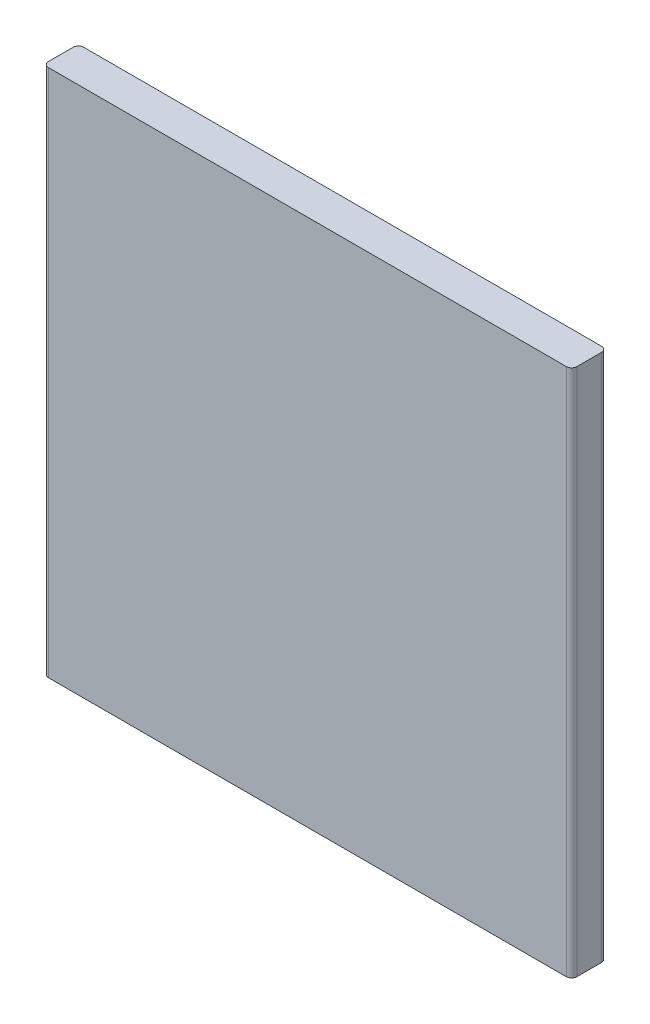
from build123d import *

# Parameters (mm, degrees)
SKETCH1_W           = 30
SKETCH1_H           = 30
BOSS_EXTRUDE1_DEPTH = 2
FILLET1_R           = 0.3


with BuildPart() as part:
    # Sketch1 → Boss-Extrude1 (new body)
    with BuildSketch(Plane.XY):
        with Locations((15, 15)):
            Rectangle(SKETCH1_W, SKETCH1_H)
    extrude(amount=BOSS_EXTRUDE1_DEPTH)

    # Fillet1
    fillet1_edges = [part.edges().sort_by_distance(p)[0] for p in [
        (30, 15, 2),
        (0, 15, 2),
        (30, 15, 0),
        (0, 15, 0),
    ]]
    fillet(fillet1_edges, radius=FILLET1_R)


solid = part.part
